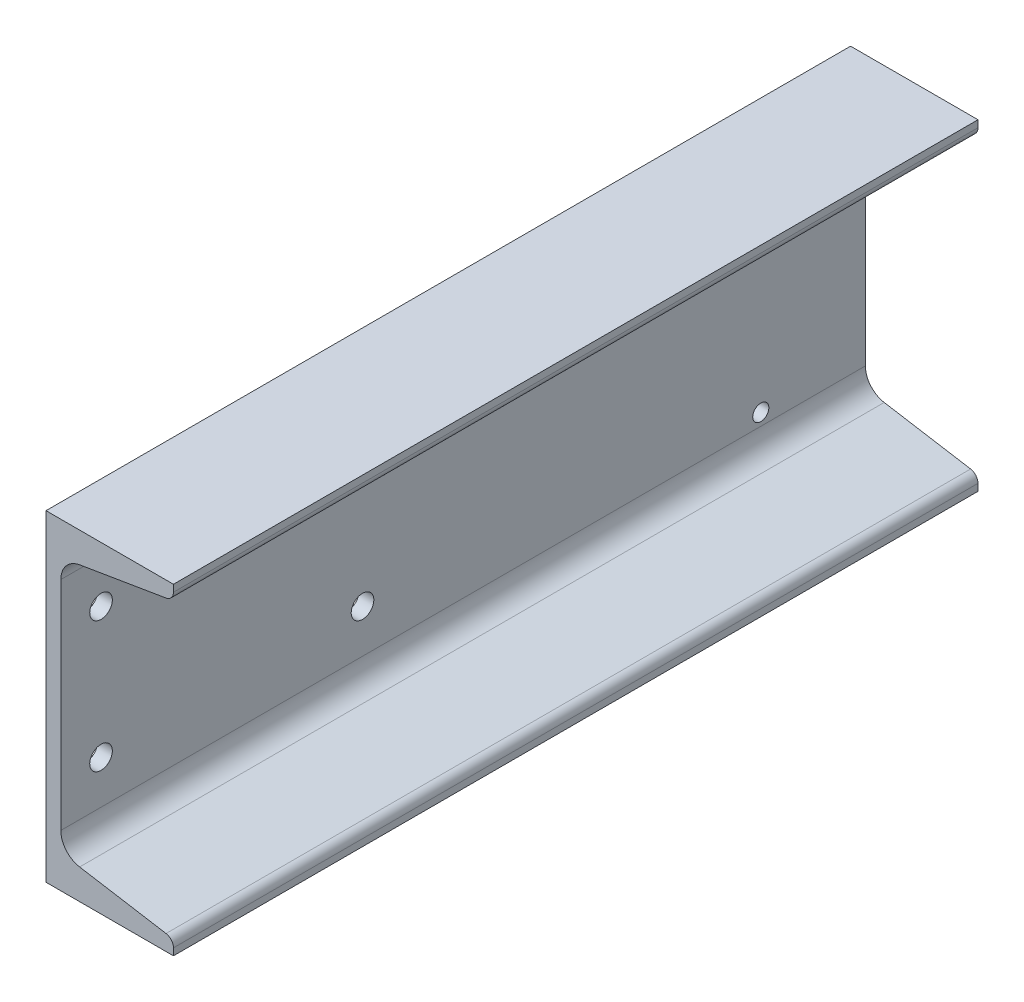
ISO-10303-21;
HEADER;
FILE_DESCRIPTION(('STEP AP214'),'2;1');
FILE_NAME('part.step','',(''),(''),'','','');
FILE_SCHEMA(('AUTOMOTIVE_DESIGN { 1 0 10303 214 1 1 1 1 }'));
ENDSEC;
DATA;
#1=APPLICATION_CONTEXT('core data for automotive mechanical design processes');
#2=APPLICATION_PROTOCOL_DEFINITION('international standard','automotive_design',2000,#1);
#3=PRODUCT_CONTEXT('',#1,'mechanical');
#4=PRODUCT('Part','Part','',(#3));
#5=PRODUCT_RELATED_PRODUCT_CATEGORY('part','',(#4));
#6=PRODUCT_DEFINITION_FORMATION('','',#4);
#7=PRODUCT_DEFINITION_CONTEXT('part definition',#1,'design');
#8=PRODUCT_DEFINITION('design','',#6,#7);
#9=PRODUCT_DEFINITION_SHAPE('','',#8);
#10=(LENGTH_UNIT() NAMED_UNIT(*) SI_UNIT(.MILLI.,.METRE.));
#11=(NAMED_UNIT(*) PLANE_ANGLE_UNIT() SI_UNIT($,.RADIAN.));
#12=(NAMED_UNIT(*) SI_UNIT($,.STERADIAN.) SOLID_ANGLE_UNIT());
#13=UNCERTAINTY_MEASURE_WITH_UNIT(LENGTH_MEASURE(1.E-05),#10,'distance_accuracy_value','');
#14=(GEOMETRIC_REPRESENTATION_CONTEXT(3) GLOBAL_UNCERTAINTY_ASSIGNED_CONTEXT((#13)) GLOBAL_UNIT_ASSIGNED_CONTEXT((#10,
#11,#12)) REPRESENTATION_CONTEXT('',''));
#15=CARTESIAN_POINT('',(0.,0.,0.));
#16=DIRECTION('',(0.,0.,1.));
#17=DIRECTION('',(1.,0.,0.));
#18=AXIS2_PLACEMENT_3D('',#15,#16,#17);
#19=CARTESIAN_POINT('',(0.,0.35199420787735,254.));
#20=DIRECTION('',(0.,1.,0.));
#21=DIRECTION('',(-1.,0.,0.));
#22=AXIS2_PLACEMENT_3D('',#19,#20,#21);
#23=PLANE('',#22);
#24=DIRECTION('',(1.,0.,0.));
#25=VECTOR('',#24,1.);
#26=CARTESIAN_POINT('',(0.,0.35199420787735,0.));
#27=LINE('',#26,#25);
#28=CARTESIAN_POINT('',(0.,0.35199420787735,0.));
#29=VERTEX_POINT('',#28);
#30=CARTESIAN_POINT('',(40.2336,0.351994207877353,0.));
#31=VERTEX_POINT('',#30);
#32=EDGE_CURVE('E120',#29,#31,#27,.T.);
#33=ORIENTED_EDGE('',*,*,#32,.T.);
#34=DIRECTION('',(0.,0.,-1.));
#35=VECTOR('',#34,1.);
#36=CARTESIAN_POINT('',(40.2336,0.351994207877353,254.));
#37=LINE('',#36,#35);
#38=CARTESIAN_POINT('',(40.2336,0.351994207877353,254.));
#39=VERTEX_POINT('',#38);
#40=EDGE_CURVE('E11',#39,#31,#37,.T.);
#41=ORIENTED_EDGE('',*,*,#40,.F.);
#42=DIRECTION('',(1.,0.,0.));
#43=VECTOR('',#42,1.);
#44=CARTESIAN_POINT('',(0.,0.35199420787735,254.));
#45=LINE('',#44,#43);
#46=CARTESIAN_POINT('',(0.,0.35199420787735,254.));
#47=VERTEX_POINT('',#46);
#48=EDGE_CURVE('E160',#47,#39,#45,.T.);
#49=ORIENTED_EDGE('',*,*,#48,.F.);
#50=DIRECTION('',(0.,0.,-1.));
#51=VECTOR('',#50,1.);
#52=CARTESIAN_POINT('',(0.,0.35199420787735,254.));
#53=LINE('',#52,#51);
#54=EDGE_CURVE('E133',#47,#29,#53,.T.);
#55=ORIENTED_EDGE('',*,*,#54,.T.);
#56=EDGE_LOOP('',(#33,#41,#49,#55));
#57=FACE_BOUND('',#56,.T.);
#58=ADVANCED_FACE('F28',(#57),#23,.F.);
#59=CARTESIAN_POINT('',(40.2336,0.351994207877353,254.));
#60=DIRECTION('',(-1.,0.,0.));
#61=DIRECTION('',(0.,0.,1.));
#62=AXIS2_PLACEMENT_3D('',#59,#60,#61);
#63=PLANE('',#62);
#64=DIRECTION('',(0.,1.,0.));
#65=VECTOR('',#64,1.);
#66=CARTESIAN_POINT('',(40.2336,0.351994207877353,0.));
#67=LINE('',#66,#65);
#68=CARTESIAN_POINT('',(40.2336,2.54,0.));
#69=VERTEX_POINT('',#68);
#70=EDGE_CURVE('E116',#31,#69,#67,.T.);
#71=ORIENTED_EDGE('',*,*,#70,.T.);
#72=DIRECTION('',(0.,0.,-1.));
#73=VECTOR('',#72,1.);
#74=CARTESIAN_POINT('',(40.2336,2.54,254.));
#75=LINE('',#74,#73);
#76=CARTESIAN_POINT('',(40.2336,2.54,254.));
#77=VERTEX_POINT('',#76);
#78=EDGE_CURVE('E35',#77,#69,#75,.T.);
#79=ORIENTED_EDGE('',*,*,#78,.F.);
#80=DIRECTION('',(0.,1.,0.));
#81=VECTOR('',#80,1.);
#82=CARTESIAN_POINT('',(40.2336,0.351994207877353,254.));
#83=LINE('',#82,#81);
#84=EDGE_CURVE('E129',#39,#77,#83,.T.);
#85=ORIENTED_EDGE('',*,*,#84,.F.);
#86=ORIENTED_EDGE('',*,*,#40,.T.);
#87=EDGE_LOOP('',(#71,#79,#85,#86));
#88=FACE_BOUND('',#87,.T.);
#89=ADVANCED_FACE('F128',(#88),#63,.F.);
#90=CARTESIAN_POINT('',(37.4396,2.54,254.));
#91=DIRECTION('',(0.,0.,-1.));
#92=DIRECTION('',(-1.,0.,0.));
#93=AXIS2_PLACEMENT_3D('',#90,#91,#92);
#94=CYLINDRICAL_SURFACE('',#93,2.794);
#95=CARTESIAN_POINT('',(37.4396,2.54,0.));
#96=DIRECTION('',(0.,0.,1.));
#97=DIRECTION('',(1.,0.,0.));
#98=AXIS2_PLACEMENT_3D('',#95,#96,#97);
#99=CIRCLE('',#98,2.794);
#100=CARTESIAN_POINT('',(37.8989633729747,5.29597918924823,0.));
#101=VERTEX_POINT('',#100);
#102=EDGE_CURVE('E122',#69,#101,#99,.T.);
#103=ORIENTED_EDGE('',*,*,#102,.T.);
#104=DIRECTION('',(0.,0.,-1.));
#105=VECTOR('',#104,1.);
#106=CARTESIAN_POINT('',(37.8989633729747,5.29597918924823,254.));
#107=LINE('',#106,#105);
#108=CARTESIAN_POINT('',(37.8989633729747,5.29597918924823,254.));
#109=VERTEX_POINT('',#108);
#110=EDGE_CURVE('E206',#109,#101,#107,.T.);
#111=ORIENTED_EDGE('',*,*,#110,.F.);
#112=CARTESIAN_POINT('',(37.4396,2.54,254.));
#113=DIRECTION('',(0.,0.,1.));
#114=DIRECTION('',(1.,0.,0.));
#115=AXIS2_PLACEMENT_3D('',#112,#113,#114);
#116=CIRCLE('',#115,2.794);
#117=EDGE_CURVE('E163',#77,#109,#116,.T.);
#118=ORIENTED_EDGE('',*,*,#117,.F.);
#119=ORIENTED_EDGE('',*,*,#78,.T.);
#120=EDGE_LOOP('',(#103,#111,#118,#119));
#121=FACE_BOUND('',#120,.T.);
#122=ADVANCED_FACE('F210',(#121),#94,.T.);
#123=CARTESIAN_POINT('',(10.6163114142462,9.84341956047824,254.));
#124=DIRECTION('',(-0.164410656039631,-0.986391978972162,0.));
#125=DIRECTION('',(0.986391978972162,-0.164410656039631,0.));
#126=AXIS2_PLACEMENT_3D('',#123,#124,#125);
#127=PLANE('',#126);
#128=DIRECTION('',(-0.986391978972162,0.164410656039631,0.));
#129=VECTOR('',#128,1.);
#130=CARTESIAN_POINT('',(10.6163114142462,9.84341956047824,0.));
#131=LINE('',#130,#129);
#132=CARTESIAN_POINT('',(10.6163114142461,9.84341956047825,0.));
#133=VERTEX_POINT('',#132);
#134=EDGE_CURVE('E142',#101,#133,#131,.T.);
#135=ORIENTED_EDGE('',*,*,#134,.T.);
#136=DIRECTION('',(0.,0.,-1.));
#137=VECTOR('',#136,1.);
#138=CARTESIAN_POINT('',(10.6163114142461,9.84341956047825,254.));
#139=LINE('',#138,#137);
#140=CARTESIAN_POINT('',(10.6163114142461,9.84341956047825,254.));
#141=VERTEX_POINT('',#140);
#142=EDGE_CURVE('E203',#141,#133,#139,.T.);
#143=ORIENTED_EDGE('',*,*,#142,.F.);
#144=DIRECTION('',(-0.986391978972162,0.164410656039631,0.));
#145=VECTOR('',#144,1.);
#146=CARTESIAN_POINT('',(10.6163114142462,9.84341956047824,254.));
#147=LINE('',#146,#145);
#148=EDGE_CURVE('E165',#109,#141,#147,.T.);
#149=ORIENTED_EDGE('',*,*,#148,.F.);
#150=ORIENTED_EDGE('',*,*,#110,.T.);
#151=EDGE_LOOP('',(#135,#143,#149,#150));
#152=FACE_BOUND('',#151,.T.);
#153=ADVANCED_FACE('F218',(#152),#127,.F.);
#154=CARTESIAN_POINT('',(11.7856,16.8586393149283,254.));
#155=DIRECTION('',(0.,0.,-1.));
#156=DIRECTION('',(-1.,0.,0.));
#157=AXIS2_PLACEMENT_3D('',#154,#155,#156);
#158=CYLINDRICAL_SURFACE('',#157,7.112);
#159=CARTESIAN_POINT('',(11.7856,16.8586393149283,0.));
#160=DIRECTION('',(0.,0.,-1.));
#161=DIRECTION('',(1.,0.,0.));
#162=AXIS2_PLACEMENT_3D('',#159,#160,#161);
#163=CIRCLE('',#162,7.112);
#164=CARTESIAN_POINT('',(4.67360000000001,16.8586393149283,0.));
#165=VERTEX_POINT('',#164);
#166=EDGE_CURVE('E144',#133,#165,#163,.T.);
#167=ORIENTED_EDGE('',*,*,#166,.T.);
#168=DIRECTION('',(0.,0.,-1.));
#169=VECTOR('',#168,1.);
#170=CARTESIAN_POINT('',(4.67360000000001,16.8586393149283,254.));
#171=LINE('',#170,#169);
#172=CARTESIAN_POINT('',(4.67360000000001,16.8586393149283,254.));
#173=VERTEX_POINT('',#172);
#174=EDGE_CURVE('E200',#173,#165,#171,.T.);
#175=ORIENTED_EDGE('',*,*,#174,.F.);
#176=CARTESIAN_POINT('',(11.7856,16.8586393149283,254.));
#177=DIRECTION('',(0.,0.,-1.));
#178=DIRECTION('',(1.,0.,0.));
#179=AXIS2_PLACEMENT_3D('',#176,#177,#178);
#180=CIRCLE('',#179,7.112);
#181=EDGE_CURVE('E167',#141,#173,#180,.T.);
#182=ORIENTED_EDGE('',*,*,#181,.F.);
#183=ORIENTED_EDGE('',*,*,#142,.T.);
#184=EDGE_LOOP('',(#167,#175,#182,#183));
#185=FACE_BOUND('',#184,.T.);
#186=ADVANCED_FACE('F221',(#185),#158,.F.);
#187=CARTESIAN_POINT('',(4.6736,85.4453491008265,254.));
#188=DIRECTION('',(-1.,0.,0.));
#189=DIRECTION('',(0.,-1.,0.));
#190=AXIS2_PLACEMENT_3D('',#187,#188,#189);
#191=PLANE('',#190);
#192=CARTESIAN_POINT('',(4.6736,20.6719942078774,33.02));
#193=DIRECTION('',(-1.,0.,0.));
#194=DIRECTION('',(0.,-1.,0.));
#195=AXIS2_PLACEMENT_3D('',#192,#193,#194);
#196=CIRCLE('',#195,2.54);
#197=CARTESIAN_POINT('',(4.6736,18.1319942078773,33.02));
#198=VERTEX_POINT('',#197);
#199=EDGE_CURVE('E389',#198,#198,#196,.T.);
#200=ORIENTED_EDGE('',*,*,#199,.T.);
#201=EDGE_LOOP('',(#200));
#202=FACE_BOUND('',#201,.T.);
#203=CARTESIAN_POINT('',(4.6736,81.6319942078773,33.02));
#204=DIRECTION('',(-1.,0.,0.));
#205=DIRECTION('',(0.,-1.,0.));
#206=AXIS2_PLACEMENT_3D('',#203,#204,#205);
#207=CIRCLE('',#206,2.54);
#208=CARTESIAN_POINT('',(4.6736,79.0919942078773,33.02));
#209=VERTEX_POINT('',#208);
#210=EDGE_CURVE('E393',#209,#209,#207,.T.);
#211=ORIENTED_EDGE('',*,*,#210,.T.);
#212=EDGE_LOOP('',(#211));
#213=FACE_BOUND('',#212,.T.);
#214=CARTESIAN_POINT('',(4.6736,30.5017942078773,241.3));
#215=DIRECTION('',(-1.,0.,0.));
#216=DIRECTION('',(0.,-1.,0.));
#217=AXIS2_PLACEMENT_3D('',#214,#215,#216);
#218=CIRCLE('',#217,3.56870000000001);
#219=CARTESIAN_POINT('',(4.6736,26.9330942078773,241.3));
#220=VERTEX_POINT('',#219);
#221=EDGE_CURVE('E402',#220,#220,#218,.T.);
#222=ORIENTED_EDGE('',*,*,#221,.T.);
#223=EDGE_LOOP('',(#222));
#224=FACE_BOUND('',#223,.T.);
#225=CARTESIAN_POINT('',(4.6736,30.5017942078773,158.75));
#226=DIRECTION('',(-1.,0.,0.));
#227=DIRECTION('',(0.,-1.,0.));
#228=AXIS2_PLACEMENT_3D('',#225,#226,#227);
#229=CIRCLE('',#228,3.56870000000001);
#230=CARTESIAN_POINT('',(4.6736,26.9330942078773,158.75));
#231=VERTEX_POINT('',#230);
#232=EDGE_CURVE('E408',#231,#231,#229,.T.);
#233=ORIENTED_EDGE('',*,*,#232,.T.);
#234=EDGE_LOOP('',(#233));
#235=FACE_BOUND('',#234,.T.);
#236=CARTESIAN_POINT('',(4.6736,71.7767942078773,241.3));
#237=DIRECTION('',(-1.,0.,0.));
#238=DIRECTION('',(0.,-1.,0.));
#239=AXIS2_PLACEMENT_3D('',#236,#237,#238);
#240=CIRCLE('',#239,3.56870000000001);
#241=CARTESIAN_POINT('',(4.6736,68.2080942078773,241.3));
#242=VERTEX_POINT('',#241);
#243=EDGE_CURVE('E414',#242,#242,#240,.T.);
#244=ORIENTED_EDGE('',*,*,#243,.T.);
#245=EDGE_LOOP('',(#244));
#246=FACE_BOUND('',#245,.T.);
#247=CARTESIAN_POINT('',(4.6736,71.7767942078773,158.75));
#248=DIRECTION('',(-1.,0.,0.));
#249=DIRECTION('',(0.,-1.,0.));
#250=AXIS2_PLACEMENT_3D('',#247,#248,#249);
#251=CIRCLE('',#250,3.56870000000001);
#252=CARTESIAN_POINT('',(4.6736,68.2080942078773,158.75));
#253=VERTEX_POINT('',#252);
#254=EDGE_CURVE('E134',#253,#253,#251,.T.);
#255=ORIENTED_EDGE('',*,*,#254,.T.);
#256=EDGE_LOOP('',(#255));
#257=FACE_BOUND('',#256,.T.);
#258=DIRECTION('',(0.,1.,0.));
#259=VECTOR('',#258,1.);
#260=CARTESIAN_POINT('',(4.6736,85.4453491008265,0.));
#261=LINE('',#260,#259);
#262=CARTESIAN_POINT('',(4.67359999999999,85.4453491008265,0.));
#263=VERTEX_POINT('',#262);
#264=EDGE_CURVE('E146',#165,#263,#261,.T.);
#265=ORIENTED_EDGE('',*,*,#264,.T.);
#266=DIRECTION('',(0.,0.,-1.));
#267=VECTOR('',#266,1.);
#268=CARTESIAN_POINT('',(4.67359999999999,85.4453491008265,254.));
#269=LINE('',#268,#267);
#270=CARTESIAN_POINT('',(4.67359999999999,85.4453491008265,254.));
#271=VERTEX_POINT('',#270);
#272=EDGE_CURVE('E197',#271,#263,#269,.T.);
#273=ORIENTED_EDGE('',*,*,#272,.F.);
#274=DIRECTION('',(0.,1.,0.));
#275=VECTOR('',#274,1.);
#276=CARTESIAN_POINT('',(4.6736,85.4453491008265,254.));
#277=LINE('',#276,#275);
#278=EDGE_CURVE('E169',#173,#271,#277,.T.);
#279=ORIENTED_EDGE('',*,*,#278,.F.);
#280=ORIENTED_EDGE('',*,*,#174,.T.);
#281=EDGE_LOOP('',(#265,#273,#279,#280));
#282=FACE_BOUND('',#281,.T.);
#283=ADVANCED_FACE('F226',(#202,#213,#224,#235,#246,#257,#282),#191,.F.);
#284=CARTESIAN_POINT('',(11.7856,85.4453491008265,254.));
#285=DIRECTION('',(0.,0.,-1.));
#286=DIRECTION('',(-1.,0.,0.));
#287=AXIS2_PLACEMENT_3D('',#284,#285,#286);
#288=CYLINDRICAL_SURFACE('',#287,7.112);
#289=CARTESIAN_POINT('',(11.7856,85.4453491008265,0.));
#290=DIRECTION('',(0.,0.,-1.));
#291=DIRECTION('',(-1.,0.,0.));
#292=AXIS2_PLACEMENT_3D('',#289,#290,#291);
#293=CIRCLE('',#292,7.112);
#294=CARTESIAN_POINT('',(10.6163114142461,92.4605688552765,0.));
#295=VERTEX_POINT('',#294);
#296=EDGE_CURVE('E148',#263,#295,#293,.T.);
#297=ORIENTED_EDGE('',*,*,#296,.T.);
#298=DIRECTION('',(0.,0.,-1.));
#299=VECTOR('',#298,1.);
#300=CARTESIAN_POINT('',(10.6163114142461,92.4605688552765,254.));
#301=LINE('',#300,#299);
#302=CARTESIAN_POINT('',(10.6163114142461,92.4605688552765,254.));
#303=VERTEX_POINT('',#302);
#304=EDGE_CURVE('E194',#303,#295,#301,.T.);
#305=ORIENTED_EDGE('',*,*,#304,.F.);
#306=CARTESIAN_POINT('',(11.7856,85.4453491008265,254.));
#307=DIRECTION('',(0.,0.,-1.));
#308=DIRECTION('',(-1.,0.,0.));
#309=AXIS2_PLACEMENT_3D('',#306,#307,#308);
#310=CIRCLE('',#309,7.112);
#311=EDGE_CURVE('E171',#271,#303,#310,.T.);
#312=ORIENTED_EDGE('',*,*,#311,.F.);
#313=ORIENTED_EDGE('',*,*,#272,.T.);
#314=EDGE_LOOP('',(#297,#305,#312,#313));
#315=FACE_BOUND('',#314,.T.);
#316=ADVANCED_FACE('F232',(#315),#288,.F.);
#317=CARTESIAN_POINT('',(10.6163114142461,92.4605688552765,254.));
#318=DIRECTION('',(-0.164410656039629,0.986391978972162,0.));
#319=DIRECTION('',(-0.986391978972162,-0.164410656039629,0.));
#320=AXIS2_PLACEMENT_3D('',#317,#318,#319);
#321=PLANE('',#320);
#322=DIRECTION('',(0.986391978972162,0.164410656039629,0.));
#323=VECTOR('',#322,1.);
#324=CARTESIAN_POINT('',(10.6163114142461,92.4605688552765,0.));
#325=LINE('',#324,#323);
#326=CARTESIAN_POINT('',(37.8989633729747,97.0080092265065,0.));
#327=VERTEX_POINT('',#326);
#328=EDGE_CURVE('E150',#295,#327,#325,.T.);
#329=ORIENTED_EDGE('',*,*,#328,.T.);
#330=DIRECTION('',(0.,0.,-1.));
#331=VECTOR('',#330,1.);
#332=CARTESIAN_POINT('',(37.8989633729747,97.0080092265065,254.));
#333=LINE('',#332,#331);
#334=CARTESIAN_POINT('',(37.8989633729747,97.0080092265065,254.));
#335=VERTEX_POINT('',#334);
#336=EDGE_CURVE('E191',#335,#327,#333,.T.);
#337=ORIENTED_EDGE('',*,*,#336,.F.);
#338=DIRECTION('',(0.986391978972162,0.164410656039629,0.));
#339=VECTOR('',#338,1.);
#340=CARTESIAN_POINT('',(10.6163114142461,92.4605688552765,254.));
#341=LINE('',#340,#339);
#342=EDGE_CURVE('E173',#303,#335,#341,.T.);
#343=ORIENTED_EDGE('',*,*,#342,.F.);
#344=ORIENTED_EDGE('',*,*,#304,.T.);
#345=EDGE_LOOP('',(#329,#337,#343,#344));
#346=FACE_BOUND('',#345,.T.);
#347=ADVANCED_FACE('F236',(#346),#321,.F.);
#348=CARTESIAN_POINT('',(37.4396,99.7639884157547,254.));
#349=DIRECTION('',(0.,0.,-1.));
#350=DIRECTION('',(-1.,0.,0.));
#351=AXIS2_PLACEMENT_3D('',#348,#349,#350);
#352=CYLINDRICAL_SURFACE('',#351,2.794);
#353=CARTESIAN_POINT('',(37.4396,99.7639884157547,0.));
#354=DIRECTION('',(0.,0.,1.));
#355=DIRECTION('',(-1.,0.,0.));
#356=AXIS2_PLACEMENT_3D('',#353,#354,#355);
#357=CIRCLE('',#356,2.794);
#358=CARTESIAN_POINT('',(40.2336,99.7639884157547,0.));
#359=VERTEX_POINT('',#358);
#360=EDGE_CURVE('E152',#327,#359,#357,.T.);
#361=ORIENTED_EDGE('',*,*,#360,.T.);
#362=DIRECTION('',(0.,0.,-1.));
#363=VECTOR('',#362,1.);
#364=CARTESIAN_POINT('',(40.2336,99.7639884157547,254.));
#365=LINE('',#364,#363);
#366=CARTESIAN_POINT('',(40.2336,99.7639884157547,254.));
#367=VERTEX_POINT('',#366);
#368=EDGE_CURVE('E188',#367,#359,#365,.T.);
#369=ORIENTED_EDGE('',*,*,#368,.F.);
#370=CARTESIAN_POINT('',(37.4396,99.7639884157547,254.));
#371=DIRECTION('',(0.,0.,1.));
#372=DIRECTION('',(-1.,0.,0.));
#373=AXIS2_PLACEMENT_3D('',#370,#371,#372);
#374=CIRCLE('',#373,2.794);
#375=EDGE_CURVE('E175',#335,#367,#374,.T.);
#376=ORIENTED_EDGE('',*,*,#375,.F.);
#377=ORIENTED_EDGE('',*,*,#336,.T.);
#378=EDGE_LOOP('',(#361,#369,#376,#377));
#379=FACE_BOUND('',#378,.T.);
#380=ADVANCED_FACE('F241',(#379),#352,.T.);
#381=CARTESIAN_POINT('',(40.2336,101.951994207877,254.));
#382=DIRECTION('',(-1.,0.,0.));
#383=DIRECTION('',(0.,-1.,0.));
#384=AXIS2_PLACEMENT_3D('',#381,#382,#383);
#385=PLANE('',#384);
#386=DIRECTION('',(0.,1.,0.));
#387=VECTOR('',#386,1.);
#388=CARTESIAN_POINT('',(40.2336,101.951994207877,0.));
#389=LINE('',#388,#387);
#390=CARTESIAN_POINT('',(40.2336,101.951994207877,0.));
#391=VERTEX_POINT('',#390);
#392=EDGE_CURVE('E154',#359,#391,#389,.T.);
#393=ORIENTED_EDGE('',*,*,#392,.T.);
#394=DIRECTION('',(0.,0.,-1.));
#395=VECTOR('',#394,1.);
#396=CARTESIAN_POINT('',(40.2336,101.951994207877,254.));
#397=LINE('',#396,#395);
#398=CARTESIAN_POINT('',(40.2336,101.951994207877,254.));
#399=VERTEX_POINT('',#398);
#400=EDGE_CURVE('E185',#399,#391,#397,.T.);
#401=ORIENTED_EDGE('',*,*,#400,.F.);
#402=DIRECTION('',(0.,1.,0.));
#403=VECTOR('',#402,1.);
#404=CARTESIAN_POINT('',(40.2336,101.951994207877,254.));
#405=LINE('',#404,#403);
#406=EDGE_CURVE('E177',#367,#399,#405,.T.);
#407=ORIENTED_EDGE('',*,*,#406,.F.);
#408=ORIENTED_EDGE('',*,*,#368,.T.);
#409=EDGE_LOOP('',(#393,#401,#407,#408));
#410=FACE_BOUND('',#409,.T.);
#411=ADVANCED_FACE('F245',(#410),#385,.F.);
#412=CARTESIAN_POINT('',(0.,101.951994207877,254.));
#413=DIRECTION('',(0.,-1.,0.));
#414=DIRECTION('',(0.,0.,-1.));
#415=AXIS2_PLACEMENT_3D('',#412,#413,#414);
#416=PLANE('',#415);
#417=DIRECTION('',(-1.,0.,0.));
#418=VECTOR('',#417,1.);
#419=CARTESIAN_POINT('',(0.,101.951994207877,0.));
#420=LINE('',#419,#418);
#421=CARTESIAN_POINT('',(0.,101.951994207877,0.));
#422=VERTEX_POINT('',#421);
#423=EDGE_CURVE('E156',#391,#422,#420,.T.);
#424=ORIENTED_EDGE('',*,*,#423,.T.);
#425=DIRECTION('',(0.,0.,-1.));
#426=VECTOR('',#425,1.);
#427=CARTESIAN_POINT('',(0.,101.951994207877,254.));
#428=LINE('',#427,#426);
#429=CARTESIAN_POINT('',(0.,101.951994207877,254.));
#430=VERTEX_POINT('',#429);
#431=EDGE_CURVE('E182',#430,#422,#428,.T.);
#432=ORIENTED_EDGE('',*,*,#431,.F.);
#433=DIRECTION('',(-1.,0.,0.));
#434=VECTOR('',#433,1.);
#435=CARTESIAN_POINT('',(0.,101.951994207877,254.));
#436=LINE('',#435,#434);
#437=EDGE_CURVE('E47',#399,#430,#436,.T.);
#438=ORIENTED_EDGE('',*,*,#437,.F.);
#439=ORIENTED_EDGE('',*,*,#400,.T.);
#440=EDGE_LOOP('',(#424,#432,#438,#439));
#441=FACE_BOUND('',#440,.T.);
#442=ADVANCED_FACE('F249',(#441),#416,.F.);
#443=CARTESIAN_POINT('',(0.,0.35199420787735,254.));
#444=DIRECTION('',(1.,0.,0.));
#445=DIRECTION('',(0.,1.,0.));
#446=AXIS2_PLACEMENT_3D('',#443,#444,#445);
#447=PLANE('',#446);
#448=CARTESIAN_POINT('',(0.,20.6719942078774,33.02));
#449=DIRECTION('',(-1.,0.,0.));
#450=DIRECTION('',(0.,1.,0.));
#451=AXIS2_PLACEMENT_3D('',#448,#449,#450);
#452=CIRCLE('',#451,2.54);
#453=CARTESIAN_POINT('',(0.,23.2119942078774,33.02));
#454=VERTEX_POINT('',#453);
#455=EDGE_CURVE('E386',#454,#454,#452,.T.);
#456=ORIENTED_EDGE('',*,*,#455,.F.);
#457=EDGE_LOOP('',(#456));
#458=FACE_BOUND('',#457,.T.);
#459=CARTESIAN_POINT('',(0.,81.6319942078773,33.02));
#460=DIRECTION('',(-1.,0.,0.));
#461=DIRECTION('',(0.,-1.,0.));
#462=AXIS2_PLACEMENT_3D('',#459,#460,#461);
#463=CIRCLE('',#462,2.54);
#464=CARTESIAN_POINT('',(0.,79.0919942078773,33.02));
#465=VERTEX_POINT('',#464);
#466=EDGE_CURVE('E390',#465,#465,#463,.T.);
#467=ORIENTED_EDGE('',*,*,#466,.F.);
#468=EDGE_LOOP('',(#467));
#469=FACE_BOUND('',#468,.T.);
#470=CARTESIAN_POINT('',(0.,30.5017942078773,241.3));
#471=DIRECTION('',(-1.,0.,0.));
#472=DIRECTION('',(0.,-1.,0.));
#473=AXIS2_PLACEMENT_3D('',#470,#471,#472);
#474=CIRCLE('',#473,3.56870000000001);
#475=CARTESIAN_POINT('',(0.,26.9330942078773,241.3));
#476=VERTEX_POINT('',#475);
#477=EDGE_CURVE('E399',#476,#476,#474,.T.);
#478=ORIENTED_EDGE('',*,*,#477,.F.);
#479=EDGE_LOOP('',(#478));
#480=FACE_BOUND('',#479,.T.);
#481=CARTESIAN_POINT('',(0.,30.5017942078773,158.75));
#482=DIRECTION('',(-1.,0.,0.));
#483=DIRECTION('',(0.,-1.,0.));
#484=AXIS2_PLACEMENT_3D('',#481,#482,#483);
#485=CIRCLE('',#484,3.56870000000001);
#486=CARTESIAN_POINT('',(0.,26.9330942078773,158.75));
#487=VERTEX_POINT('',#486);
#488=EDGE_CURVE('E405',#487,#487,#485,.T.);
#489=ORIENTED_EDGE('',*,*,#488,.F.);
#490=EDGE_LOOP('',(#489));
#491=FACE_BOUND('',#490,.T.);
#492=CARTESIAN_POINT('',(0.,71.7767942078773,241.3));
#493=DIRECTION('',(-1.,0.,0.));
#494=DIRECTION('',(0.,-1.,0.));
#495=AXIS2_PLACEMENT_3D('',#492,#493,#494);
#496=CIRCLE('',#495,3.56870000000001);
#497=CARTESIAN_POINT('',(0.,68.2080942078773,241.3));
#498=VERTEX_POINT('',#497);
#499=EDGE_CURVE('E411',#498,#498,#496,.T.);
#500=ORIENTED_EDGE('',*,*,#499,.F.);
#501=EDGE_LOOP('',(#500));
#502=FACE_BOUND('',#501,.T.);
#503=CARTESIAN_POINT('',(0.,71.7767942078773,158.75));
#504=DIRECTION('',(-1.,0.,0.));
#505=DIRECTION('',(0.,-1.,0.));
#506=AXIS2_PLACEMENT_3D('',#503,#504,#505);
#507=CIRCLE('',#506,3.56870000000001);
#508=CARTESIAN_POINT('',(0.,68.2080942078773,158.75));
#509=VERTEX_POINT('',#508);
#510=EDGE_CURVE('E137',#509,#509,#507,.T.);
#511=ORIENTED_EDGE('',*,*,#510,.F.);
#512=EDGE_LOOP('',(#511));
#513=FACE_BOUND('',#512,.T.);
#514=DIRECTION('',(0.,-1.,0.));
#515=VECTOR('',#514,1.);
#516=CARTESIAN_POINT('',(0.,0.35199420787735,0.));
#517=LINE('',#516,#515);
#518=EDGE_CURVE('E158',#422,#29,#517,.T.);
#519=ORIENTED_EDGE('',*,*,#518,.T.);
#520=ORIENTED_EDGE('',*,*,#54,.F.);
#521=DIRECTION('',(0.,-1.,0.));
#522=VECTOR('',#521,1.);
#523=CARTESIAN_POINT('',(0.,0.35199420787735,254.));
#524=LINE('',#523,#522);
#525=EDGE_CURVE('E42',#430,#47,#524,.T.);
#526=ORIENTED_EDGE('',*,*,#525,.F.);
#527=ORIENTED_EDGE('',*,*,#431,.T.);
#528=EDGE_LOOP('',(#519,#520,#526,#527));
#529=FACE_BOUND('',#528,.T.);
#530=ADVANCED_FACE('F251',(#458,#469,#480,#491,#502,#513,#529),#447,.F.);
#531=CARTESIAN_POINT('',(37.4396,2.54,254.));
#532=DIRECTION('',(0.,0.,1.));
#533=DIRECTION('',(1.,0.,0.));
#534=AXIS2_PLACEMENT_3D('',#531,#532,#533);
#535=PLANE('',#534);
#536=ORIENTED_EDGE('',*,*,#48,.T.);
#537=ORIENTED_EDGE('',*,*,#84,.T.);
#538=ORIENTED_EDGE('',*,*,#117,.T.);
#539=ORIENTED_EDGE('',*,*,#148,.T.);
#540=ORIENTED_EDGE('',*,*,#181,.T.);
#541=ORIENTED_EDGE('',*,*,#278,.T.);
#542=ORIENTED_EDGE('',*,*,#311,.T.);
#543=ORIENTED_EDGE('',*,*,#342,.T.);
#544=ORIENTED_EDGE('',*,*,#375,.T.);
#545=ORIENTED_EDGE('',*,*,#406,.T.);
#546=ORIENTED_EDGE('',*,*,#437,.T.);
#547=ORIENTED_EDGE('',*,*,#525,.T.);
#548=EDGE_LOOP('',(#536,#537,#538,#539,#540,#541,#542,#543,#544,#545,#546,#547));
#549=FACE_BOUND('',#548,.T.);
#550=ADVANCED_FACE('F213',(#549),#535,.T.);
#551=CARTESIAN_POINT('',(37.4396,2.54,0.));
#552=DIRECTION('',(0.,0.,1.));
#553=DIRECTION('',(1.,0.,0.));
#554=AXIS2_PLACEMENT_3D('',#551,#552,#553);
#555=PLANE('',#554);
#556=ORIENTED_EDGE('',*,*,#32,.F.);
#557=ORIENTED_EDGE('',*,*,#518,.F.);
#558=ORIENTED_EDGE('',*,*,#423,.F.);
#559=ORIENTED_EDGE('',*,*,#392,.F.);
#560=ORIENTED_EDGE('',*,*,#360,.F.);
#561=ORIENTED_EDGE('',*,*,#328,.F.);
#562=ORIENTED_EDGE('',*,*,#296,.F.);
#563=ORIENTED_EDGE('',*,*,#264,.F.);
#564=ORIENTED_EDGE('',*,*,#166,.F.);
#565=ORIENTED_EDGE('',*,*,#134,.F.);
#566=ORIENTED_EDGE('',*,*,#102,.F.);
#567=ORIENTED_EDGE('',*,*,#70,.F.);
#568=EDGE_LOOP('',(#556,#557,#558,#559,#560,#561,#562,#563,#564,#565,#566,#567));
#569=FACE_BOUND('',#568,.T.);
#570=ADVANCED_FACE('F117',(#569),#555,.F.);
#571=CARTESIAN_POINT('',(40.2336,71.7767942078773,158.75));
#572=DIRECTION('',(-1.,0.,0.));
#573=DIRECTION('',(0.,-1.,0.));
#574=AXIS2_PLACEMENT_3D('',#571,#572,#573);
#575=CYLINDRICAL_SURFACE('',#574,3.56870000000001);
#576=ORIENTED_EDGE('',*,*,#510,.T.);
#577=EDGE_LOOP('',(#576));
#578=FACE_BOUND('',#577,.T.);
#579=ORIENTED_EDGE('',*,*,#254,.F.);
#580=EDGE_LOOP('',(#579));
#581=FACE_BOUND('',#580,.T.);
#582=ADVANCED_FACE('F305',(#578,#581),#575,.F.);
#583=CARTESIAN_POINT('',(40.2336,71.7767942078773,241.3));
#584=DIRECTION('',(-1.,0.,0.));
#585=DIRECTION('',(0.,-1.,0.));
#586=AXIS2_PLACEMENT_3D('',#583,#584,#585);
#587=CYLINDRICAL_SURFACE('',#586,3.56870000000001);
#588=ORIENTED_EDGE('',*,*,#499,.T.);
#589=EDGE_LOOP('',(#588));
#590=FACE_BOUND('',#589,.T.);
#591=ORIENTED_EDGE('',*,*,#243,.F.);
#592=EDGE_LOOP('',(#591));
#593=FACE_BOUND('',#592,.T.);
#594=ADVANCED_FACE('F312',(#590,#593),#587,.F.);
#595=CARTESIAN_POINT('',(40.2336,30.5017942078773,158.75));
#596=DIRECTION('',(-1.,0.,0.));
#597=DIRECTION('',(0.,-1.,0.));
#598=AXIS2_PLACEMENT_3D('',#595,#596,#597);
#599=CYLINDRICAL_SURFACE('',#598,3.56870000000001);
#600=ORIENTED_EDGE('',*,*,#488,.T.);
#601=EDGE_LOOP('',(#600));
#602=FACE_BOUND('',#601,.T.);
#603=ORIENTED_EDGE('',*,*,#232,.F.);
#604=EDGE_LOOP('',(#603));
#605=FACE_BOUND('',#604,.T.);
#606=ADVANCED_FACE('F320',(#602,#605),#599,.F.);
#607=CARTESIAN_POINT('',(40.2336,30.5017942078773,241.3));
#608=DIRECTION('',(-1.,0.,0.));
#609=DIRECTION('',(0.,-1.,0.));
#610=AXIS2_PLACEMENT_3D('',#607,#608,#609);
#611=CYLINDRICAL_SURFACE('',#610,3.56870000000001);
#612=ORIENTED_EDGE('',*,*,#477,.T.);
#613=EDGE_LOOP('',(#612));
#614=FACE_BOUND('',#613,.T.);
#615=ORIENTED_EDGE('',*,*,#221,.F.);
#616=EDGE_LOOP('',(#615));
#617=FACE_BOUND('',#616,.T.);
#618=ADVANCED_FACE('F328',(#614,#617),#611,.F.);
#619=CARTESIAN_POINT('',(40.2336,81.6319942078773,33.02));
#620=DIRECTION('',(-1.,0.,0.));
#621=DIRECTION('',(0.,-1.,0.));
#622=AXIS2_PLACEMENT_3D('',#619,#620,#621);
#623=CYLINDRICAL_SURFACE('',#622,2.54);
#624=ORIENTED_EDGE('',*,*,#466,.T.);
#625=EDGE_LOOP('',(#624));
#626=FACE_BOUND('',#625,.T.);
#627=ORIENTED_EDGE('',*,*,#210,.F.);
#628=EDGE_LOOP('',(#627));
#629=FACE_BOUND('',#628,.T.);
#630=ADVANCED_FACE('F335',(#626,#629),#623,.F.);
#631=CARTESIAN_POINT('',(40.2336,20.6719942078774,33.02));
#632=DIRECTION('',(-1.,0.,0.));
#633=DIRECTION('',(0.,-1.,0.));
#634=AXIS2_PLACEMENT_3D('',#631,#632,#633);
#635=CYLINDRICAL_SURFACE('',#634,2.54);
#636=ORIENTED_EDGE('',*,*,#455,.T.);
#637=EDGE_LOOP('',(#636));
#638=FACE_BOUND('',#637,.T.);
#639=ORIENTED_EDGE('',*,*,#199,.F.);
#640=EDGE_LOOP('',(#639));
#641=FACE_BOUND('',#640,.T.);
#642=ADVANCED_FACE('F374',(#638,#641),#635,.F.);
#643=CLOSED_SHELL('',(#58,#89,#122,#153,#186,#283,#316,#347,#380,#411,#442,#530,#550,#570,#582,
#594,#606,#618,#630,#642));
#644=MANIFOLD_SOLID_BREP('B2',#643);
#645=ADVANCED_BREP_SHAPE_REPRESENTATION('',(#18,#644),#14);
#646=SHAPE_DEFINITION_REPRESENTATION(#9,#645);
ENDSEC;
END-ISO-10303-21;
